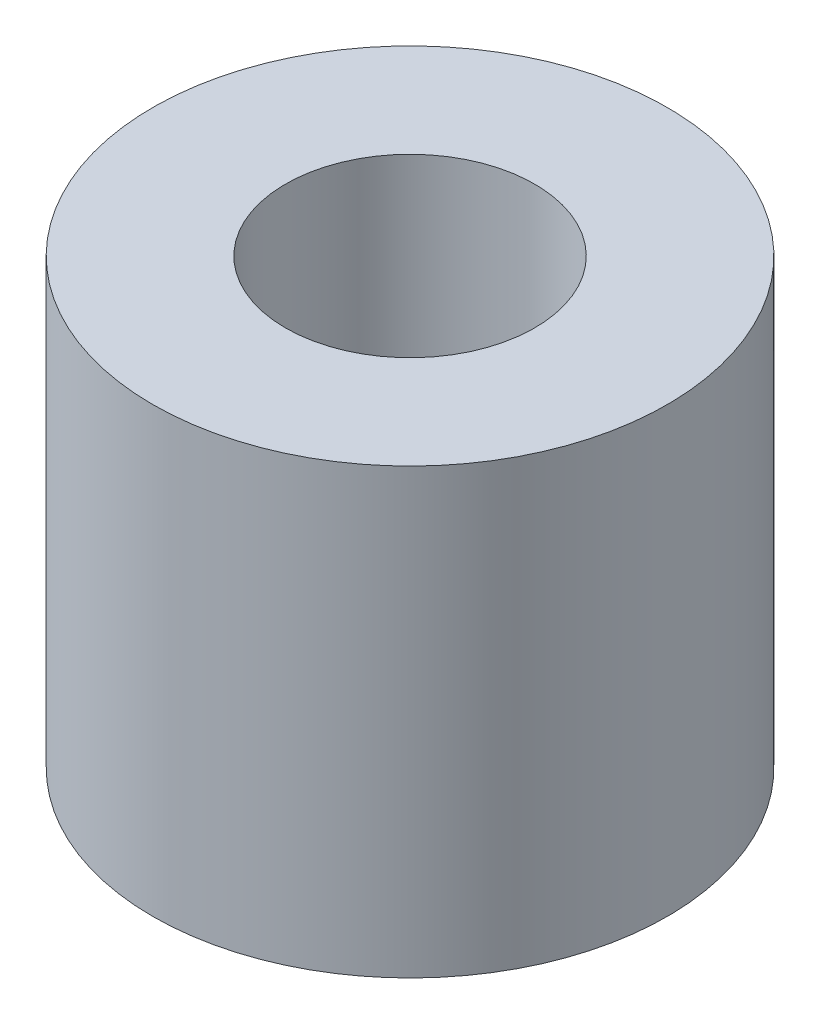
from build123d import *

# Parameters (mm, degrees)
SKETCH1_R           = 2.27122893
SKETCH1_R_2         = 1.10000034
BOSS_EXTRUDE1_DEPTH = 3.91351897


with BuildPart() as part:
    # Sketch1 → Boss-Extrude1 (new body)
    with BuildSketch(Plane(origin=(0, 0, 0), x_dir=(1, 0, 0), z_dir=(0, 1, 0))):
        with Locations(Location((0, 0, 0), (0, 0, 270))):
            Circle(SKETCH1_R)
        with Locations(Location((0, 0, 0), (0, 0, 270))):
            Circle(SKETCH1_R_2, mode=Mode.SUBTRACT)
    extrude(amount=BOSS_EXTRUDE1_DEPTH)


solid = part.part
